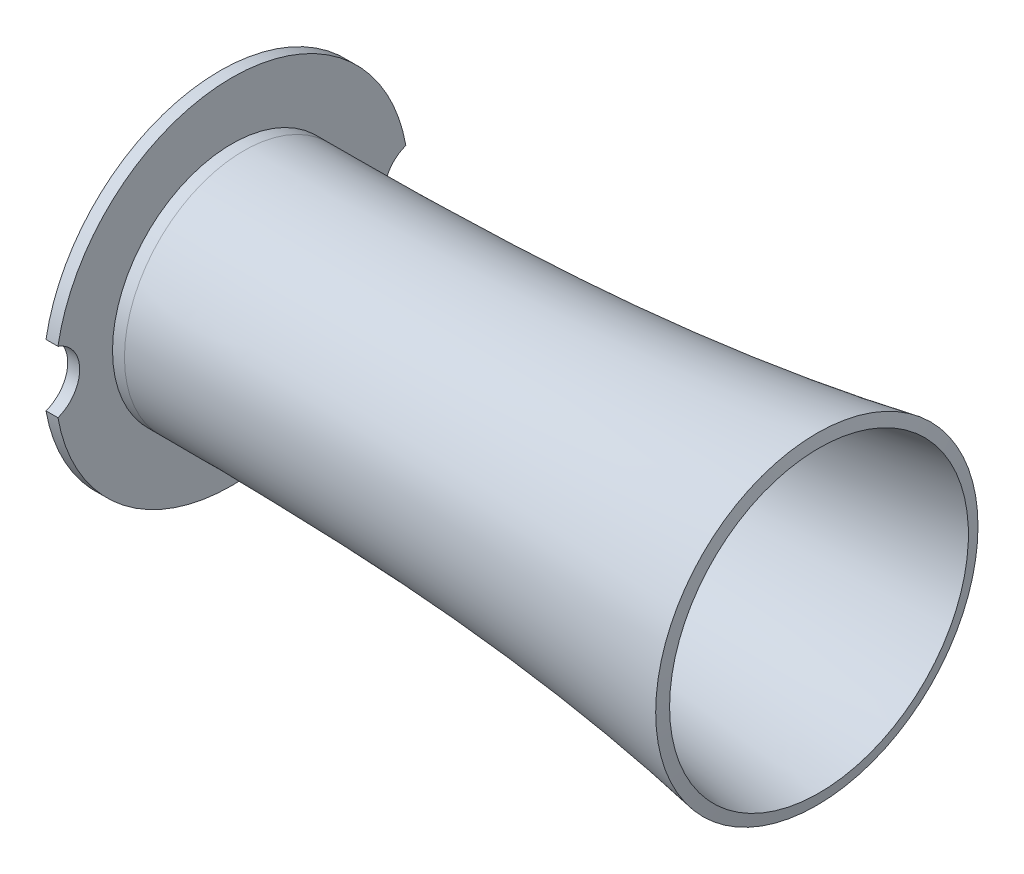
from build123d import *

# Parameters (mm, degrees)
ENL_V_MAT_EXTRU_1_REACH = 56.371
ESQUISSE2_R             = 2.75


with BuildPart() as part:
    # Esquisse1 → R_volution2 (revolve)
    with BuildSketch(Plane.XY, mode=Mode.PRIVATE) as r_volution2_sk:
        with BuildLine():
            Line((0, 14.8), (0, 9))
            Line((0, 9), (2, 9))
            add(Edge.make_bspline(
                [(2, 9), (5.99944349, 9), (14.011288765, 9.063060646), (25.947352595, 9.533825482), (35.965795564, 10.398225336), (44.043196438, 11.463485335), (48.146333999, 12.14273768), (50.180681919, 12.516458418)],
                knots=[0, 0, 0, 0, 0.25, 0.5, 0.75, 0.875, 1, 1, 1, 1], degree=3))
            Line((50.180681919, 12.516458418), (50, 13.5))
            add(Edge.make_bspline(
                [(2, 10), (18.042478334, 10), (33.687974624, 10.503392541), (50, 13.5)],
                knots=[0, 0, 0, 0, 1, 1, 1, 1], degree=3))
            Line((2, 10), (1, 10))
            Line((1, 10), (1, 14.8))
            Line((1, 14.8), (0, 14.8))
        make_face()
    revolve(r_volution2_sk.sketch.rotate(Axis((0, 0, 0), (1, 0, 0)), 90), axis=Axis((0, 0, 0), (1, 0, 0)))

    # Esquisse2 → Enl_v. mat.-Extru.1 (cut, up to next)
    with BuildSketch(Plane.ZY, mode=Mode.PRIVATE) as enl_v_mat_extru_1_sk1:
        with Locations((-15.5, 0)):
            Circle(ESQUISSE2_R)
    enl_v_mat_extru_1_tool1 = extrude(enl_v_mat_extru_1_sk1.sketch, amount=-ENL_V_MAT_EXTRU_1_REACH, mode=Mode.PRIVATE) & part.part
    # Esquisse2 → Enl_v. mat.-Extru.1 (cut, up to next)
    with BuildSketch(Plane.ZY, mode=Mode.PRIVATE) as enl_v_mat_extru_1_sk2:
        with Locations((15.5, 0)):
            Circle(ESQUISSE2_R)
    enl_v_mat_extru_1_tool2 = extrude(enl_v_mat_extru_1_sk2.sketch, amount=-ENL_V_MAT_EXTRU_1_REACH, mode=Mode.PRIVATE) & part.part
    add(enl_v_mat_extru_1_tool1.solids().sort_by_distance((0, 0, -15.5))[0], mode=Mode.SUBTRACT)
    add(enl_v_mat_extru_1_tool2.solids().sort_by_distance((0, 0, 15.5))[0], mode=Mode.SUBTRACT)


solid = part.part
